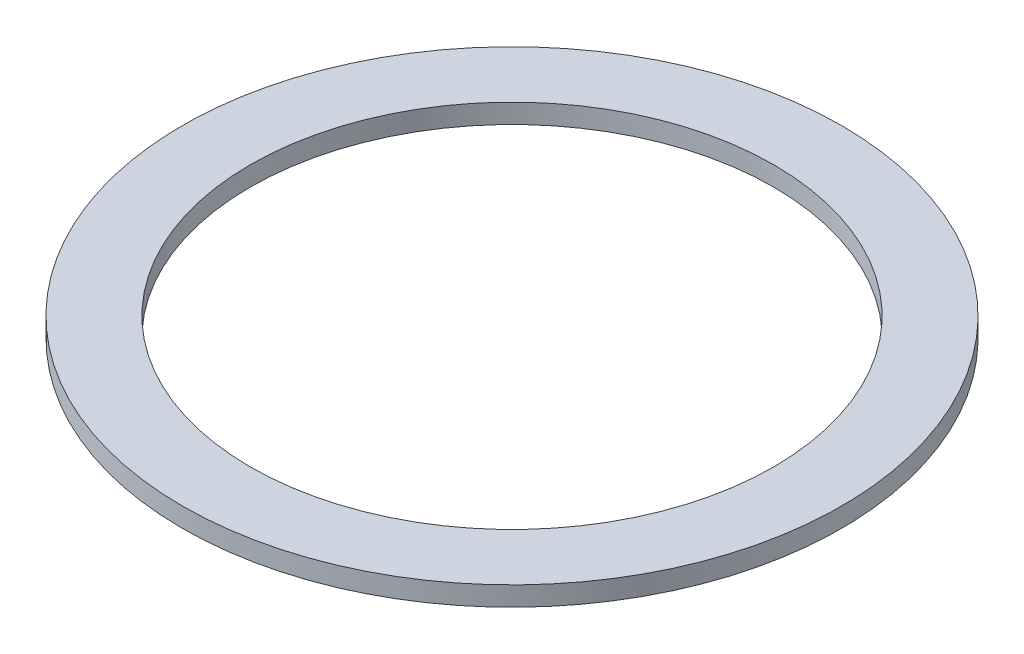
from build123d import *

# Parameters (mm, degrees)
ESQUISSE1_R      = 17
ESQUISSE1_R_2    = 13.5
EXTRUSION1_DEPTH = 1


with BuildPart() as part:
    # Esquisse1 → Extrusion1 (new body)
    with BuildSketch(Plane(origin=(0, 0, 0), x_dir=(1, 0, 0), z_dir=(0, 1, 0))):
        with Locations(Location((0, 0, 0), (0, 0, 270))):
            Circle(ESQUISSE1_R)
        with Locations(Location((0, 0, 0), (0, 0, 270))):
            Circle(ESQUISSE1_R_2, mode=Mode.SUBTRACT)
    extrude(amount=EXTRUSION1_DEPTH)


solid = part.part
